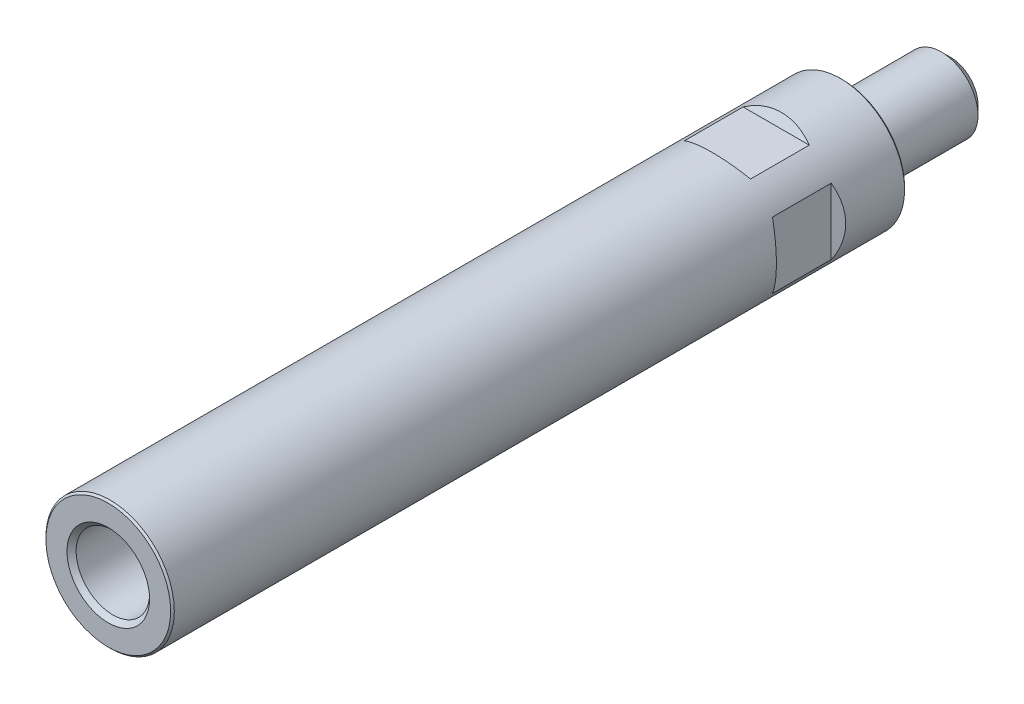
ISO-10303-21;
HEADER;
FILE_DESCRIPTION(('STEP AP214'),'2;1');
FILE_NAME('part.step','',(''),(''),'','','');
FILE_SCHEMA(('AUTOMOTIVE_DESIGN { 1 0 10303 214 1 1 1 1 }'));
ENDSEC;
DATA;
#1=APPLICATION_CONTEXT('core data for automotive mechanical design processes');
#2=APPLICATION_PROTOCOL_DEFINITION('international standard','automotive_design',2000,#1);
#3=PRODUCT_CONTEXT('',#1,'mechanical');
#4=PRODUCT('Part','Part','',(#3));
#5=PRODUCT_RELATED_PRODUCT_CATEGORY('part','',(#4));
#6=PRODUCT_DEFINITION_FORMATION('','',#4);
#7=PRODUCT_DEFINITION_CONTEXT('part definition',#1,'design');
#8=PRODUCT_DEFINITION('design','',#6,#7);
#9=PRODUCT_DEFINITION_SHAPE('','',#8);
#10=(LENGTH_UNIT() NAMED_UNIT(*) SI_UNIT(.MILLI.,.METRE.));
#11=(NAMED_UNIT(*) PLANE_ANGLE_UNIT() SI_UNIT($,.RADIAN.));
#12=(NAMED_UNIT(*) SI_UNIT($,.STERADIAN.) SOLID_ANGLE_UNIT());
#13=UNCERTAINTY_MEASURE_WITH_UNIT(LENGTH_MEASURE(1.E-05),#10,'distance_accuracy_value','');
#14=(GEOMETRIC_REPRESENTATION_CONTEXT(3) GLOBAL_UNCERTAINTY_ASSIGNED_CONTEXT((#13)) GLOBAL_UNIT_ASSIGNED_CONTEXT((#10,
#11,#12)) REPRESENTATION_CONTEXT('',''));
#15=CARTESIAN_POINT('',(0.,0.,0.));
#16=DIRECTION('',(0.,0.,1.));
#17=DIRECTION('',(1.,0.,0.));
#18=AXIS2_PLACEMENT_3D('',#15,#16,#17);
#19=CARTESIAN_POINT('',(0.,0.,-9.5));
#20=DIRECTION('',(0.,0.,1.));
#21=DIRECTION('',(1.,0.,0.));
#22=AXIS2_PLACEMENT_3D('',#19,#20,#21);
#23=CYLINDRICAL_SURFACE('',#22,10.);
#24=CARTESIAN_POINT('',(0.,0.,-27.));
#25=DIRECTION('',(0.,0.,1.));
#26=DIRECTION('',(1.,0.,0.));
#27=AXIS2_PLACEMENT_3D('',#24,#25,#26);
#28=CIRCLE('',#27,10.);
#29=CARTESIAN_POINT('',(10.,0.,-27.));
#30=VERTEX_POINT('',#29);
#31=EDGE_CURVE('E249',#30,#30,#28,.T.);
#32=ORIENTED_EDGE('',*,*,#31,.T.);
#33=EDGE_LOOP('',(#32));
#34=FACE_BOUND('',#33,.T.);
#35=CARTESIAN_POINT('',(0.,0.,1.25));
#36=DIRECTION('',(0.,0.,-1.));
#37=DIRECTION('',(-1.,0.,0.));
#38=AXIS2_PLACEMENT_3D('',#35,#36,#37);
#39=CIRCLE('',#38,10.);
#40=CARTESIAN_POINT('',(-10.,0.,1.25));
#41=VERTEX_POINT('',#40);
#42=EDGE_CURVE('E26',#41,#41,#39,.T.);
#43=ORIENTED_EDGE('',*,*,#42,.T.);
#44=EDGE_LOOP('',(#43));
#45=FACE_BOUND('',#44,.T.);
#46=ADVANCED_FACE('F15',(#34,#45),#23,.T.);
#47=CARTESIAN_POINT('',(0.,0.,-27.));
#48=DIRECTION('',(0.,0.,1.));
#49=DIRECTION('',(1.,0.,0.));
#50=AXIS2_PLACEMENT_3D('',#47,#48,#49);
#51=CONICAL_SURFACE('',#50,10.,0.785398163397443);
#52=CARTESIAN_POINT('',(0.,0.,-29.5));
#53=DIRECTION('',(0.,0.,1.));
#54=DIRECTION('',(1.,0.,0.));
#55=AXIS2_PLACEMENT_3D('',#52,#53,#54);
#56=CIRCLE('',#55,7.5);
#57=CARTESIAN_POINT('',(7.5,0.,-29.5));
#58=VERTEX_POINT('',#57);
#59=EDGE_CURVE('E19',#58,#58,#56,.T.);
#60=ORIENTED_EDGE('',*,*,#59,.T.);
#61=EDGE_LOOP('',(#60));
#62=FACE_BOUND('',#61,.T.);
#63=ORIENTED_EDGE('',*,*,#31,.F.);
#64=EDGE_LOOP('',(#63));
#65=FACE_BOUND('',#64,.T.);
#66=ADVANCED_FACE('F302',(#62,#65),#51,.T.);
#67=CARTESIAN_POINT('',(0.,0.,-29.5));
#68=DIRECTION('',(0.,0.,1.));
#69=DIRECTION('',(1.,0.,0.));
#70=AXIS2_PLACEMENT_3D('',#67,#68,#69);
#71=PLANE('',#70);
#72=ORIENTED_EDGE('',*,*,#59,.F.);
#73=EDGE_LOOP('',(#72));
#74=FACE_BOUND('',#73,.T.);
#75=ADVANCED_FACE('F17',(#74),#71,.F.);
#76=CARTESIAN_POINT('',(0.,0.,0.));
#77=DIRECTION('',(0.,0.,-1.));
#78=DIRECTION('',(-1.,0.,0.));
#79=AXIS2_PLACEMENT_3D('',#76,#77,#78);
#80=CONICAL_SURFACE('',#79,11.25,0.785398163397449);
#81=CARTESIAN_POINT('',(0.,0.,0.));
#82=DIRECTION('',(0.,0.,-1.));
#83=DIRECTION('',(-1.,0.,0.));
#84=AXIS2_PLACEMENT_3D('',#81,#82,#83);
#85=CIRCLE('',#84,11.25);
#86=CARTESIAN_POINT('',(-11.25,0.,0.));
#87=VERTEX_POINT('',#86);
#88=EDGE_CURVE('E202',#87,#87,#85,.T.);
#89=ORIENTED_EDGE('',*,*,#88,.T.);
#90=EDGE_LOOP('',(#89));
#91=FACE_BOUND('',#90,.T.);
#92=ORIENTED_EDGE('',*,*,#42,.F.);
#93=EDGE_LOOP('',(#92));
#94=FACE_BOUND('',#93,.T.);
#95=ADVANCED_FACE('F301',(#91,#94),#80,.F.);
#96=CARTESIAN_POINT('',(0.,0.,0.));
#97=DIRECTION('',(0.,0.,1.));
#98=DIRECTION('',(1.,0.,0.));
#99=AXIS2_PLACEMENT_3D('',#96,#97,#98);
#100=PLANE('',#99);
#101=CARTESIAN_POINT('',(0.,0.,0.));
#102=DIRECTION('',(0.,0.,1.));
#103=DIRECTION('',(1.,0.,0.));
#104=AXIS2_PLACEMENT_3D('',#101,#102,#103);
#105=CIRCLE('',#104,17.);
#106=CARTESIAN_POINT('',(17.,0.,0.));
#107=VERTEX_POINT('',#106);
#108=EDGE_CURVE('E193',#107,#107,#105,.F.);
#109=ORIENTED_EDGE('',*,*,#108,.T.);
#110=EDGE_LOOP('',(#109));
#111=FACE_BOUND('',#110,.T.);
#112=ORIENTED_EDGE('',*,*,#88,.F.);
#113=EDGE_LOOP('',(#112));
#114=FACE_BOUND('',#113,.T.);
#115=ADVANCED_FACE('F308',(#111,#114),#100,.F.);
#116=CARTESIAN_POINT('',(0.,0.,0.499999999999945));
#117=DIRECTION('',(0.,0.,1.));
#118=DIRECTION('',(1.,0.,0.));
#119=AXIS2_PLACEMENT_3D('',#116,#117,#118);
#120=CONICAL_SURFACE('',#119,17.5,0.785398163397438);
#121=ORIENTED_EDGE('',*,*,#108,.F.);
#122=EDGE_LOOP('',(#121));
#123=FACE_BOUND('',#122,.T.);
#124=CARTESIAN_POINT('',(0.,0.,0.499999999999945));
#125=DIRECTION('',(0.,0.,1.));
#126=DIRECTION('',(1.,0.,0.));
#127=AXIS2_PLACEMENT_3D('',#124,#125,#126);
#128=CIRCLE('',#127,17.5);
#129=CARTESIAN_POINT('',(17.5,0.,0.499999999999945));
#130=VERTEX_POINT('',#129);
#131=EDGE_CURVE('E190',#130,#130,#128,.T.);
#132=ORIENTED_EDGE('',*,*,#131,.F.);
#133=EDGE_LOOP('',(#132));
#134=FACE_BOUND('',#133,.T.);
#135=ADVANCED_FACE('F357',(#123,#134),#120,.T.);
#136=CARTESIAN_POINT('',(0.,0.,200.));
#137=DIRECTION('',(0.,0.,-1.));
#138=DIRECTION('',(-1.,0.,0.));
#139=AXIS2_PLACEMENT_3D('',#136,#137,#138);
#140=CYLINDRICAL_SURFACE('',#139,17.5);
#141=ORIENTED_EDGE('',*,*,#131,.T.);
#142=EDGE_LOOP('',(#141));
#143=FACE_BOUND('',#142,.T.);
#144=CARTESIAN_POINT('',(0.,0.,199.5));
#145=DIRECTION('',(0.,0.,1.));
#146=DIRECTION('',(1.,0.,0.));
#147=AXIS2_PLACEMENT_3D('',#144,#145,#146);
#148=CIRCLE('',#147,17.5);
#149=CARTESIAN_POINT('',(17.5,0.,199.5));
#150=VERTEX_POINT('',#149);
#151=EDGE_CURVE('E187',#150,#150,#148,.F.);
#152=ORIENTED_EDGE('',*,*,#151,.T.);
#153=EDGE_LOOP('',(#152));
#154=FACE_BOUND('',#153,.T.);
#155=CARTESIAN_POINT('',(0.,0.,26.6602540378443));
#156=DIRECTION('',(0.5,0.,-0.86602540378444));
#157=DIRECTION('',(-0.86602540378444,0.,-0.5));
#158=AXIS2_PLACEMENT_3D('',#155,#156,#157);
#159=ELLIPSE('',#158,20.2072594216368,17.5);
#160=CARTESIAN_POINT('',(-15.,-9.01387818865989,18.));
#161=VERTEX_POINT('',#160);
#162=CARTESIAN_POINT('',(-15.,9.01387818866,18.));
#163=VERTEX_POINT('',#162);
#164=EDGE_CURVE('E176',#161,#163,#159,.T.);
#165=ORIENTED_EDGE('',*,*,#164,.T.);
#166=DIRECTION('',(0.,0.,-1.));
#167=VECTOR('',#166,1.);
#168=CARTESIAN_POINT('',(-15.,9.01387818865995,200.));
#169=LINE('',#168,#167);
#170=CARTESIAN_POINT('',(-15.,9.01387818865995,34.));
#171=VERTEX_POINT('',#170);
#172=EDGE_CURVE('E184',#163,#171,#169,.F.);
#173=ORIENTED_EDGE('',*,*,#172,.T.);
#174=CARTESIAN_POINT('',(0.,0.,25.3397459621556));
#175=DIRECTION('',(0.5,0.,0.86602540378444));
#176=DIRECTION('',(0.86602540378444,0.,-0.5));
#177=AXIS2_PLACEMENT_3D('',#174,#175,#176);
#178=ELLIPSE('',#177,20.2072594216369,17.5);
#179=CARTESIAN_POINT('',(-15.,-9.01387818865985,34.));
#180=VERTEX_POINT('',#179);
#181=EDGE_CURVE('E181',#171,#180,#178,.T.);
#182=ORIENTED_EDGE('',*,*,#181,.T.);
#183=DIRECTION('',(0.,0.,-1.));
#184=VECTOR('',#183,1.);
#185=CARTESIAN_POINT('',(-15.,-9.01387818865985,200.));
#186=LINE('',#185,#184);
#187=EDGE_CURVE('E178',#180,#161,#186,.T.);
#188=ORIENTED_EDGE('',*,*,#187,.T.);
#189=EDGE_LOOP('',(#165,#173,#182,#188));
#190=FACE_BOUND('',#189,.T.);
#191=CARTESIAN_POINT('',(0.,0.,26.6602540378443));
#192=DIRECTION('',(-0.5,0.,-0.86602540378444));
#193=DIRECTION('',(0.86602540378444,0.,-0.5));
#194=AXIS2_PLACEMENT_3D('',#191,#192,#193);
#195=ELLIPSE('',#194,20.2072594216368,17.5);
#196=CARTESIAN_POINT('',(15.,9.01387818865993,18.));
#197=VERTEX_POINT('',#196);
#198=CARTESIAN_POINT('',(15.,-9.01387818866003,18.));
#199=VERTEX_POINT('',#198);
#200=EDGE_CURVE('E174',#197,#199,#195,.T.);
#201=ORIENTED_EDGE('',*,*,#200,.T.);
#202=DIRECTION('',(0.,0.,-1.));
#203=VECTOR('',#202,1.);
#204=CARTESIAN_POINT('',(15.,-9.01387818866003,200.));
#205=LINE('',#204,#203);
#206=CARTESIAN_POINT('',(15.,-9.01387818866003,34.));
#207=VERTEX_POINT('',#206);
#208=EDGE_CURVE('E168',#199,#207,#205,.F.);
#209=ORIENTED_EDGE('',*,*,#208,.T.);
#210=CARTESIAN_POINT('',(0.,0.,25.3397459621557));
#211=DIRECTION('',(-0.5,0.,0.86602540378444));
#212=DIRECTION('',(-0.86602540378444,0.,-0.5));
#213=AXIS2_PLACEMENT_3D('',#210,#211,#212);
#214=ELLIPSE('',#213,20.2072594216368,17.5);
#215=CARTESIAN_POINT('',(15.,9.01387818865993,34.));
#216=VERTEX_POINT('',#215);
#217=EDGE_CURVE('E165',#207,#216,#214,.T.);
#218=ORIENTED_EDGE('',*,*,#217,.T.);
#219=DIRECTION('',(0.,0.,-1.));
#220=VECTOR('',#219,1.);
#221=CARTESIAN_POINT('',(15.,9.01387818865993,200.));
#222=LINE('',#221,#220);
#223=EDGE_CURVE('E171',#216,#197,#222,.T.);
#224=ORIENTED_EDGE('',*,*,#223,.T.);
#225=EDGE_LOOP('',(#201,#209,#218,#224));
#226=FACE_BOUND('',#225,.T.);
#227=CARTESIAN_POINT('',(0.,0.,26.6602540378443));
#228=DIRECTION('',(0.,0.5,-0.86602540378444));
#229=DIRECTION('',(0.,-0.86602540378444,-0.5));
#230=AXIS2_PLACEMENT_3D('',#227,#228,#229);
#231=ELLIPSE('',#230,20.2072594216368,17.5);
#232=CARTESIAN_POINT('',(9.01387818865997,-15.,18.));
#233=VERTEX_POINT('',#232);
#234=CARTESIAN_POINT('',(-9.01387818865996,-15.,18.));
#235=VERTEX_POINT('',#234);
#236=EDGE_CURVE('E136',#233,#235,#231,.T.);
#237=ORIENTED_EDGE('',*,*,#236,.T.);
#238=DIRECTION('',(0.,0.,-1.));
#239=VECTOR('',#238,1.);
#240=CARTESIAN_POINT('',(-9.0138781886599,-15.,200.));
#241=LINE('',#240,#239);
#242=CARTESIAN_POINT('',(-9.0138781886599,-15.,34.));
#243=VERTEX_POINT('',#242);
#244=EDGE_CURVE('E162',#235,#243,#241,.F.);
#245=ORIENTED_EDGE('',*,*,#244,.T.);
#246=CARTESIAN_POINT('',(0.,0.,25.3397459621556));
#247=DIRECTION('',(0.,0.5,0.86602540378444));
#248=DIRECTION('',(0.,0.86602540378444,-0.5));
#249=AXIS2_PLACEMENT_3D('',#246,#247,#248);
#250=ELLIPSE('',#249,20.2072594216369,17.5);
#251=CARTESIAN_POINT('',(9.0138781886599,-15.,34.));
#252=VERTEX_POINT('',#251);
#253=EDGE_CURVE('E159',#243,#252,#250,.T.);
#254=ORIENTED_EDGE('',*,*,#253,.T.);
#255=DIRECTION('',(0.,0.,-1.));
#256=VECTOR('',#255,1.);
#257=CARTESIAN_POINT('',(9.0138781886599,-15.,200.));
#258=LINE('',#257,#256);
#259=EDGE_CURVE('E156',#252,#233,#258,.T.);
#260=ORIENTED_EDGE('',*,*,#259,.T.);
#261=EDGE_LOOP('',(#237,#245,#254,#260));
#262=FACE_BOUND('',#261,.T.);
#263=CARTESIAN_POINT('',(0.,0.,26.6602540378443));
#264=DIRECTION('',(0.,-0.5,-0.86602540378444));
#265=DIRECTION('',(0.,0.86602540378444,-0.5));
#266=AXIS2_PLACEMENT_3D('',#263,#264,#265);
#267=ELLIPSE('',#266,20.2072594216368,17.5);
#268=CARTESIAN_POINT('',(-9.01387818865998,15.,18.));
#269=VERTEX_POINT('',#268);
#270=CARTESIAN_POINT('',(9.01387818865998,15.,18.));
#271=VERTEX_POINT('',#270);
#272=EDGE_CURVE('E126',#269,#271,#267,.T.);
#273=ORIENTED_EDGE('',*,*,#272,.T.);
#274=DIRECTION('',(0.,0.,-1.));
#275=VECTOR('',#274,1.);
#276=CARTESIAN_POINT('',(9.01387818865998,15.,200.));
#277=LINE('',#276,#275);
#278=CARTESIAN_POINT('',(9.01387818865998,15.,34.));
#279=VERTEX_POINT('',#278);
#280=EDGE_CURVE('E130',#271,#279,#277,.F.);
#281=ORIENTED_EDGE('',*,*,#280,.T.);
#282=CARTESIAN_POINT('',(0.,0.,25.3397459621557));
#283=DIRECTION('',(0.,-0.5,0.86602540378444));
#284=DIRECTION('',(0.,-0.86602540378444,-0.5));
#285=AXIS2_PLACEMENT_3D('',#282,#283,#284);
#286=ELLIPSE('',#285,20.2072594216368,17.5);
#287=CARTESIAN_POINT('',(-9.01387818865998,15.,34.));
#288=VERTEX_POINT('',#287);
#289=EDGE_CURVE('E143',#279,#288,#286,.T.);
#290=ORIENTED_EDGE('',*,*,#289,.T.);
#291=DIRECTION('',(0.,0.,-1.));
#292=VECTOR('',#291,1.);
#293=CARTESIAN_POINT('',(-9.01387818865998,15.,200.));
#294=LINE('',#293,#292);
#295=EDGE_CURVE('E132',#288,#269,#294,.T.);
#296=ORIENTED_EDGE('',*,*,#295,.T.);
#297=EDGE_LOOP('',(#273,#281,#290,#296));
#298=FACE_BOUND('',#297,.T.);
#299=ADVANCED_FACE('F128',(#143,#154,#190,#226,#262,#298),#140,.T.);
#300=CARTESIAN_POINT('',(0.,0.,200.));
#301=DIRECTION('',(0.,0.,-1.));
#302=DIRECTION('',(-1.,0.,0.));
#303=AXIS2_PLACEMENT_3D('',#300,#301,#302);
#304=CONICAL_SURFACE('',#303,17.,0.785398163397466);
#305=ORIENTED_EDGE('',*,*,#151,.F.);
#306=EDGE_LOOP('',(#305));
#307=FACE_BOUND('',#306,.T.);
#308=CARTESIAN_POINT('',(0.,0.,200.));
#309=DIRECTION('',(0.,0.,1.));
#310=DIRECTION('',(1.,0.,0.));
#311=AXIS2_PLACEMENT_3D('',#308,#309,#310);
#312=CIRCLE('',#311,17.);
#313=CARTESIAN_POINT('',(17.,0.,200.));
#314=VERTEX_POINT('',#313);
#315=EDGE_CURVE('E196',#314,#314,#312,.T.);
#316=ORIENTED_EDGE('',*,*,#315,.F.);
#317=EDGE_LOOP('',(#316));
#318=FACE_BOUND('',#317,.T.);
#319=ADVANCED_FACE('F352',(#307,#318),#304,.T.);
#320=CARTESIAN_POINT('',(-15.,10.,18.));
#321=DIRECTION('',(0.5,0.,-0.86602540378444));
#322=DIRECTION('',(-0.86602540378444,0.,-0.5));
#323=AXIS2_PLACEMENT_3D('',#320,#321,#322);
#324=PLANE('',#323);
#325=ORIENTED_EDGE('',*,*,#164,.F.);
#326=DIRECTION('',(0.,-1.,0.));
#327=VECTOR('',#326,1.);
#328=CARTESIAN_POINT('',(-15.,10.,18.));
#329=LINE('',#328,#327);
#330=EDGE_CURVE('E269',#163,#161,#329,.T.);
#331=ORIENTED_EDGE('',*,*,#330,.F.);
#332=EDGE_LOOP('',(#325,#331));
#333=FACE_BOUND('',#332,.T.);
#334=ADVANCED_FACE('F355',(#333),#324,.F.);
#335=CARTESIAN_POINT('',(-15.,10.,34.));
#336=DIRECTION('',(1.,0.,0.));
#337=DIRECTION('',(0.,1.,0.));
#338=AXIS2_PLACEMENT_3D('',#335,#336,#337);
#339=PLANE('',#338);
#340=DIRECTION('',(0.,-1.,0.));
#341=VECTOR('',#340,1.);
#342=CARTESIAN_POINT('',(-15.,10.,34.));
#343=LINE('',#342,#341);
#344=EDGE_CURVE('E270',#171,#180,#343,.T.);
#345=ORIENTED_EDGE('',*,*,#344,.F.);
#346=ORIENTED_EDGE('',*,*,#172,.F.);
#347=ORIENTED_EDGE('',*,*,#330,.T.);
#348=ORIENTED_EDGE('',*,*,#187,.F.);
#349=EDGE_LOOP('',(#345,#346,#347,#348));
#350=FACE_BOUND('',#349,.T.);
#351=ADVANCED_FACE('F551',(#350),#339,.F.);
#352=CARTESIAN_POINT('',(-17.5,10.,35.443375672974));
#353=DIRECTION('',(0.5,0.,0.86602540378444));
#354=DIRECTION('',(0.86602540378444,0.,-0.5));
#355=AXIS2_PLACEMENT_3D('',#352,#353,#354);
#356=PLANE('',#355);
#357=ORIENTED_EDGE('',*,*,#344,.T.);
#358=ORIENTED_EDGE('',*,*,#181,.F.);
#359=EDGE_LOOP('',(#357,#358));
#360=FACE_BOUND('',#359,.T.);
#361=ADVANCED_FACE('F542',(#360),#356,.F.);
#362=CARTESIAN_POINT('',(15.,10.,18.));
#363=DIRECTION('',(-0.5,0.,-0.86602540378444));
#364=DIRECTION('',(-0.86602540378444,0.,0.5));
#365=AXIS2_PLACEMENT_3D('',#362,#363,#364);
#366=PLANE('',#365);
#367=ORIENTED_EDGE('',*,*,#200,.F.);
#368=DIRECTION('',(0.,-1.,0.));
#369=VECTOR('',#368,1.);
#370=CARTESIAN_POINT('',(15.,10.,18.));
#371=LINE('',#370,#369);
#372=EDGE_CURVE('E275',#197,#199,#371,.T.);
#373=ORIENTED_EDGE('',*,*,#372,.T.);
#374=EDGE_LOOP('',(#367,#373));
#375=FACE_BOUND('',#374,.T.);
#376=ADVANCED_FACE('F533',(#375),#366,.F.);
#377=CARTESIAN_POINT('',(15.,10.,34.));
#378=DIRECTION('',(-1.,0.,0.));
#379=DIRECTION('',(0.,-1.,0.));
#380=AXIS2_PLACEMENT_3D('',#377,#378,#379);
#381=PLANE('',#380);
#382=DIRECTION('',(0.,-1.,0.));
#383=VECTOR('',#382,1.);
#384=CARTESIAN_POINT('',(15.,10.,34.));
#385=LINE('',#384,#383);
#386=EDGE_CURVE('E34',#216,#207,#385,.T.);
#387=ORIENTED_EDGE('',*,*,#386,.T.);
#388=ORIENTED_EDGE('',*,*,#208,.F.);
#389=ORIENTED_EDGE('',*,*,#372,.F.);
#390=ORIENTED_EDGE('',*,*,#223,.F.);
#391=EDGE_LOOP('',(#387,#388,#389,#390));
#392=FACE_BOUND('',#391,.T.);
#393=ADVANCED_FACE('F525',(#392),#381,.F.);
#394=CARTESIAN_POINT('',(17.5,10.,35.443375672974));
#395=DIRECTION('',(-0.5,0.,0.86602540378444));
#396=DIRECTION('',(0.86602540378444,0.,0.5));
#397=AXIS2_PLACEMENT_3D('',#394,#395,#396);
#398=PLANE('',#397);
#399=ORIENTED_EDGE('',*,*,#386,.F.);
#400=ORIENTED_EDGE('',*,*,#217,.F.);
#401=EDGE_LOOP('',(#399,#400));
#402=FACE_BOUND('',#401,.T.);
#403=ADVANCED_FACE('F517',(#402),#398,.F.);
#404=CARTESIAN_POINT('',(-10.,-15.,18.));
#405=DIRECTION('',(0.,0.5,-0.86602540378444));
#406=DIRECTION('',(0.,0.86602540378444,0.5));
#407=AXIS2_PLACEMENT_3D('',#404,#405,#406);
#408=PLANE('',#407);
#409=ORIENTED_EDGE('',*,*,#236,.F.);
#410=DIRECTION('',(1.,0.,0.));
#411=VECTOR('',#410,1.);
#412=CARTESIAN_POINT('',(-10.,-15.,18.));
#413=LINE('',#412,#411);
#414=EDGE_CURVE('E151',#235,#233,#413,.T.);
#415=ORIENTED_EDGE('',*,*,#414,.F.);
#416=EDGE_LOOP('',(#409,#415));
#417=FACE_BOUND('',#416,.T.);
#418=ADVANCED_FACE('F297',(#417),#408,.F.);
#419=CARTESIAN_POINT('',(-10.,-15.,34.));
#420=DIRECTION('',(0.,1.,0.));
#421=DIRECTION('',(0.,0.,1.));
#422=AXIS2_PLACEMENT_3D('',#419,#420,#421);
#423=PLANE('',#422);
#424=DIRECTION('',(1.,0.,0.));
#425=VECTOR('',#424,1.);
#426=CARTESIAN_POINT('',(-10.,-15.,34.));
#427=LINE('',#426,#425);
#428=EDGE_CURVE('E148',#243,#252,#427,.T.);
#429=ORIENTED_EDGE('',*,*,#428,.F.);
#430=ORIENTED_EDGE('',*,*,#244,.F.);
#431=ORIENTED_EDGE('',*,*,#414,.T.);
#432=ORIENTED_EDGE('',*,*,#259,.F.);
#433=EDGE_LOOP('',(#429,#430,#431,#432));
#434=FACE_BOUND('',#433,.T.);
#435=ADVANCED_FACE('F285',(#434),#423,.F.);
#436=CARTESIAN_POINT('',(-10.,-17.5,35.443375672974));
#437=DIRECTION('',(0.,0.5,0.86602540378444));
#438=DIRECTION('',(0.,-0.86602540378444,0.5));
#439=AXIS2_PLACEMENT_3D('',#436,#437,#438);
#440=PLANE('',#439);
#441=ORIENTED_EDGE('',*,*,#428,.T.);
#442=ORIENTED_EDGE('',*,*,#253,.F.);
#443=EDGE_LOOP('',(#441,#442));
#444=FACE_BOUND('',#443,.T.);
#445=ADVANCED_FACE('F288',(#444),#440,.F.);
#446=CARTESIAN_POINT('',(-10.,15.,18.));
#447=DIRECTION('',(0.,-0.5,-0.86602540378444));
#448=DIRECTION('',(0.,0.86602540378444,-0.5));
#449=AXIS2_PLACEMENT_3D('',#446,#447,#448);
#450=PLANE('',#449);
#451=ORIENTED_EDGE('',*,*,#272,.F.);
#452=DIRECTION('',(1.,0.,0.));
#453=VECTOR('',#452,1.);
#454=CARTESIAN_POINT('',(-10.,15.,18.));
#455=LINE('',#454,#453);
#456=EDGE_CURVE('E141',#269,#271,#455,.T.);
#457=ORIENTED_EDGE('',*,*,#456,.T.);
#458=EDGE_LOOP('',(#451,#457));
#459=FACE_BOUND('',#458,.T.);
#460=ADVANCED_FACE('F145',(#459),#450,.F.);
#461=CARTESIAN_POINT('',(-10.,15.,34.));
#462=DIRECTION('',(0.,-1.,0.));
#463=DIRECTION('',(0.,0.,-1.));
#464=AXIS2_PLACEMENT_3D('',#461,#462,#463);
#465=PLANE('',#464);
#466=DIRECTION('',(1.,0.,0.));
#467=VECTOR('',#466,1.);
#468=CARTESIAN_POINT('',(-10.,15.,34.));
#469=LINE('',#468,#467);
#470=EDGE_CURVE('E142',#288,#279,#469,.T.);
#471=ORIENTED_EDGE('',*,*,#470,.T.);
#472=ORIENTED_EDGE('',*,*,#280,.F.);
#473=ORIENTED_EDGE('',*,*,#456,.F.);
#474=ORIENTED_EDGE('',*,*,#295,.F.);
#475=EDGE_LOOP('',(#471,#472,#473,#474));
#476=FACE_BOUND('',#475,.T.);
#477=ADVANCED_FACE('F140',(#476),#465,.F.);
#478=CARTESIAN_POINT('',(-10.,17.5,35.443375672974));
#479=DIRECTION('',(0.,-0.5,0.86602540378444));
#480=DIRECTION('',(0.,-0.86602540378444,-0.5));
#481=AXIS2_PLACEMENT_3D('',#478,#479,#480);
#482=PLANE('',#481);
#483=ORIENTED_EDGE('',*,*,#470,.F.);
#484=ORIENTED_EDGE('',*,*,#289,.F.);
#485=EDGE_LOOP('',(#483,#484));
#486=FACE_BOUND('',#485,.T.);
#487=ADVANCED_FACE('F371',(#486),#482,.F.);
#488=CARTESIAN_POINT('',(0.,0.,200.));
#489=DIRECTION('',(0.,0.,1.));
#490=DIRECTION('',(1.,0.,0.));
#491=AXIS2_PLACEMENT_3D('',#488,#489,#490);
#492=PLANE('',#491);
#493=ORIENTED_EDGE('',*,*,#315,.T.);
#494=EDGE_LOOP('',(#493));
#495=FACE_BOUND('',#494,.T.);
#496=CARTESIAN_POINT('',(0.,0.,200.));
#497=DIRECTION('',(0.,0.,1.));
#498=DIRECTION('',(1.,0.,0.));
#499=AXIS2_PLACEMENT_3D('',#496,#497,#498);
#500=CIRCLE('',#499,11.25);
#501=CARTESIAN_POINT('',(11.25,0.,200.));
#502=VERTEX_POINT('',#501);
#503=EDGE_CURVE('E266',#502,#502,#500,.T.);
#504=ORIENTED_EDGE('',*,*,#503,.F.);
#505=EDGE_LOOP('',(#504));
#506=FACE_BOUND('',#505,.T.);
#507=ADVANCED_FACE('F367',(#495,#506),#492,.T.);
#508=CARTESIAN_POINT('',(0.,0.,200.));
#509=DIRECTION('',(0.,0.,1.));
#510=DIRECTION('',(1.,0.,0.));
#511=AXIS2_PLACEMENT_3D('',#508,#509,#510);
#512=CONICAL_SURFACE('',#511,11.25,0.785398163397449);
#513=CARTESIAN_POINT('',(0.,0.,198.75));
#514=DIRECTION('',(0.,0.,1.));
#515=DIRECTION('',(1.,0.,0.));
#516=AXIS2_PLACEMENT_3D('',#513,#514,#515);
#517=CIRCLE('',#516,10.);
#518=CARTESIAN_POINT('',(10.,0.,198.75));
#519=VERTEX_POINT('',#518);
#520=EDGE_CURVE('E199',#519,#519,#517,.F.);
#521=ORIENTED_EDGE('',*,*,#520,.T.);
#522=EDGE_LOOP('',(#521));
#523=FACE_BOUND('',#522,.T.);
#524=ORIENTED_EDGE('',*,*,#503,.T.);
#525=EDGE_LOOP('',(#524));
#526=FACE_BOUND('',#525,.T.);
#527=ADVANCED_FACE('F370',(#523,#526),#512,.F.);
#528=CARTESIAN_POINT('',(0.,0.,150.));
#529=DIRECTION('',(0.,0.,1.));
#530=DIRECTION('',(1.,0.,0.));
#531=AXIS2_PLACEMENT_3D('',#528,#529,#530);
#532=CYLINDRICAL_SURFACE('',#531,10.);
#533=CARTESIAN_POINT('',(0.,0.,150.));
#534=DIRECTION('',(0.,0.,1.));
#535=DIRECTION('',(1.,0.,0.));
#536=AXIS2_PLACEMENT_3D('',#533,#534,#535);
#537=CIRCLE('',#536,10.);
#538=CARTESIAN_POINT('',(10.,0.,150.));
#539=VERTEX_POINT('',#538);
#540=EDGE_CURVE('E203',#539,#539,#537,.T.);
#541=ORIENTED_EDGE('',*,*,#540,.F.);
#542=EDGE_LOOP('',(#541));
#543=FACE_BOUND('',#542,.T.);
#544=ORIENTED_EDGE('',*,*,#520,.F.);
#545=EDGE_LOOP('',(#544));
#546=FACE_BOUND('',#545,.T.);
#547=ADVANCED_FACE('F400',(#543,#546),#532,.F.);
#548=CARTESIAN_POINT('',(0.,0.,150.));
#549=DIRECTION('',(0.,0.,1.));
#550=DIRECTION('',(1.,0.,0.));
#551=AXIS2_PLACEMENT_3D('',#548,#549,#550);
#552=PLANE('',#551);
#553=ORIENTED_EDGE('',*,*,#540,.T.);
#554=EDGE_LOOP('',(#553));
#555=FACE_BOUND('',#554,.T.);
#556=ADVANCED_FACE('F315',(#555),#552,.T.);
#557=CLOSED_SHELL('',(#46,#66,#75,#95,#115,#135,#299,#319,#334,#351,#361,#376,#393,#403,#418,
#435,#445,#460,#477,#487,#507,#527,#547,#556));
#558=CARTESIAN_POINT('',(0.,0.,0.));
#559=DIRECTION('',(0.,0.,-1.));
#560=DIRECTION('',(-1.,0.,0.));
#561=AXIS2_PLACEMENT_3D('',#558,#559,#560);
#562=CYLINDRICAL_SURFACE('',#561,8.75);
#563=CARTESIAN_POINT('',(0.,0.,35.));
#564=DIRECTION('',(0.,0.,-1.));
#565=DIRECTION('',(-1.,0.,0.));
#566=AXIS2_PLACEMENT_3D('',#563,#564,#565);
#567=CIRCLE('',#566,8.75);
#568=CARTESIAN_POINT('',(-8.75,0.,35.));
#569=VERTEX_POINT('',#568);
#570=EDGE_CURVE('E263',#569,#569,#567,.T.);
#571=ORIENTED_EDGE('',*,*,#570,.F.);
#572=EDGE_LOOP('',(#571));
#573=FACE_BOUND('',#572,.T.);
#574=CARTESIAN_POINT('',(0.,0.,20.5));
#575=DIRECTION('',(0.,0.,-1.));
#576=DIRECTION('',(-1.,0.,0.));
#577=AXIS2_PLACEMENT_3D('',#574,#575,#576);
#578=CIRCLE('',#577,8.75);
#579=CARTESIAN_POINT('',(-8.75,0.,20.5));
#580=VERTEX_POINT('',#579);
#581=EDGE_CURVE('E9',#580,#580,#578,.F.);
#582=ORIENTED_EDGE('',*,*,#581,.F.);
#583=EDGE_LOOP('',(#582));
#584=FACE_BOUND('',#583,.T.);
#585=ADVANCED_FACE('F346',(#573,#584),#562,.F.);
#586=CARTESIAN_POINT('',(0.,0.,35.));
#587=DIRECTION('',(0.,0.,-1.));
#588=DIRECTION('',(-1.,0.,0.));
#589=AXIS2_PLACEMENT_3D('',#586,#587,#588);
#590=CONICAL_SURFACE('',#589,8.75,1.02974425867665);
#591=CARTESIAN_POINT('',(0.,0.,40.2575304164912));
#592=VERTEX_POINT('',#591);
#593=VERTEX_LOOP('',#592);
#594=FACE_BOUND('',#593,.T.);
#595=ORIENTED_EDGE('',*,*,#570,.T.);
#596=EDGE_LOOP('',(#595));
#597=FACE_BOUND('',#596,.T.);
#598=ADVANCED_FACE('F322',(#594,#597),#590,.F.);
#599=CARTESIAN_POINT('',(10.,0.,20.5));
#600=DIRECTION('',(0.,0.,-1.));
#601=DIRECTION('',(-1.,0.,0.));
#602=AXIS2_PLACEMENT_3D('',#599,#600,#601);
#603=PLANE('',#602);
#604=DIRECTION('',(0.866025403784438,-0.5,0.));
#605=VECTOR('',#604,1.);
#606=CARTESIAN_POINT('',(0.,5.77350269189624,20.5));
#607=LINE('',#606,#605);
#608=CARTESIAN_POINT('',(0.,5.77350269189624,20.5));
#609=VERTEX_POINT('',#608);
#610=CARTESIAN_POINT('',(5.,2.88675134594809,20.5));
#611=VERTEX_POINT('',#610);
#612=EDGE_CURVE('E80',#609,#611,#607,.T.);
#613=ORIENTED_EDGE('',*,*,#612,.T.);
#614=DIRECTION('',(0.,-1.,0.));
#615=VECTOR('',#614,1.);
#616=CARTESIAN_POINT('',(5.,2.88675134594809,20.5));
#617=LINE('',#616,#615);
#618=CARTESIAN_POINT('',(5.,-2.88675134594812,20.5));
#619=VERTEX_POINT('',#618);
#620=EDGE_CURVE('E219',#611,#619,#617,.T.);
#621=ORIENTED_EDGE('',*,*,#620,.T.);
#622=DIRECTION('',(0.866025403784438,0.5,0.));
#623=VECTOR('',#622,1.);
#624=CARTESIAN_POINT('',(0.,-5.77350269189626,20.5));
#625=LINE('',#624,#623);
#626=CARTESIAN_POINT('',(0.,-5.77350269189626,20.5));
#627=VERTEX_POINT('',#626);
#628=EDGE_CURVE('E216',#627,#619,#625,.T.);
#629=ORIENTED_EDGE('',*,*,#628,.F.);
#630=DIRECTION('',(-0.866025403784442,0.5,0.));
#631=VECTOR('',#630,1.);
#632=CARTESIAN_POINT('',(0.,-5.77350269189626,20.5));
#633=LINE('',#632,#631);
#634=CARTESIAN_POINT('',(-5.,-2.88675134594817,20.5));
#635=VERTEX_POINT('',#634);
#636=EDGE_CURVE('E213',#627,#635,#633,.T.);
#637=ORIENTED_EDGE('',*,*,#636,.T.);
#638=DIRECTION('',(0.,-1.,0.));
#639=VECTOR('',#638,1.);
#640=CARTESIAN_POINT('',(-5.,2.88675134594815,20.5));
#641=LINE('',#640,#639);
#642=CARTESIAN_POINT('',(-5.,2.88675134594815,20.5));
#643=VERTEX_POINT('',#642);
#644=EDGE_CURVE('E210',#643,#635,#641,.T.);
#645=ORIENTED_EDGE('',*,*,#644,.F.);
#646=DIRECTION('',(-0.866025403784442,-0.499999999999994,0.));
#647=VECTOR('',#646,1.);
#648=CARTESIAN_POINT('',(0.,5.77350269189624,20.5));
#649=LINE('',#648,#647);
#650=EDGE_CURVE('E206',#609,#643,#649,.T.);
#651=ORIENTED_EDGE('',*,*,#650,.F.);
#652=EDGE_LOOP('',(#613,#621,#629,#637,#645,#651));
#653=FACE_BOUND('',#652,.T.);
#654=ORIENTED_EDGE('',*,*,#581,.T.);
#655=EDGE_LOOP('',(#654));
#656=FACE_BOUND('',#655,.T.);
#657=ADVANCED_FACE('F318',(#653,#656),#603,.F.);
#658=CARTESIAN_POINT('',(0.,5.77350269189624,12.5));
#659=DIRECTION('',(-0.5,-0.866025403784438,0.));
#660=DIRECTION('',(0.866025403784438,-0.5,0.));
#661=AXIS2_PLACEMENT_3D('',#658,#659,#660);
#662=PLANE('',#661);
#663=DIRECTION('',(0.,0.,1.));
#664=VECTOR('',#663,1.);
#665=CARTESIAN_POINT('',(5.,2.88675134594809,12.5));
#666=LINE('',#665,#664);
#667=CARTESIAN_POINT('',(5.,2.88675134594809,12.5));
#668=VERTEX_POINT('',#667);
#669=EDGE_CURVE('E248',#668,#611,#666,.T.);
#670=ORIENTED_EDGE('',*,*,#669,.T.);
#671=ORIENTED_EDGE('',*,*,#612,.F.);
#672=DIRECTION('',(0.,0.,1.));
#673=VECTOR('',#672,1.);
#674=CARTESIAN_POINT('',(0.,5.77350269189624,12.5));
#675=LINE('',#674,#673);
#676=CARTESIAN_POINT('',(0.,5.77350269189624,12.5));
#677=VERTEX_POINT('',#676);
#678=EDGE_CURVE('E76',#677,#609,#675,.T.);
#679=ORIENTED_EDGE('',*,*,#678,.F.);
#680=DIRECTION('',(0.866025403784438,-0.5,0.));
#681=VECTOR('',#680,1.);
#682=CARTESIAN_POINT('',(0.,5.77350269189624,12.5));
#683=LINE('',#682,#681);
#684=EDGE_CURVE('E209',#677,#668,#683,.T.);
#685=ORIENTED_EDGE('',*,*,#684,.T.);
#686=EDGE_LOOP('',(#670,#671,#679,#685));
#687=FACE_BOUND('',#686,.T.);
#688=ADVANCED_FACE('F321',(#687),#662,.T.);
#689=CARTESIAN_POINT('',(5.,2.88675134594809,12.5));
#690=DIRECTION('',(-1.,0.,0.));
#691=DIRECTION('',(0.,0.,1.));
#692=AXIS2_PLACEMENT_3D('',#689,#690,#691);
#693=PLANE('',#692);
#694=DIRECTION('',(0.,0.,1.));
#695=VECTOR('',#694,1.);
#696=CARTESIAN_POINT('',(5.,-2.88675134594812,12.5));
#697=LINE('',#696,#695);
#698=CARTESIAN_POINT('',(5.,-2.88675134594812,12.5));
#699=VERTEX_POINT('',#698);
#700=EDGE_CURVE('E246',#699,#619,#697,.T.);
#701=ORIENTED_EDGE('',*,*,#700,.T.);
#702=ORIENTED_EDGE('',*,*,#620,.F.);
#703=ORIENTED_EDGE('',*,*,#669,.F.);
#704=DIRECTION('',(0.,-1.,0.));
#705=VECTOR('',#704,1.);
#706=CARTESIAN_POINT('',(5.,2.88675134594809,12.5));
#707=LINE('',#706,#705);
#708=EDGE_CURVE('E235',#668,#699,#707,.T.);
#709=ORIENTED_EDGE('',*,*,#708,.T.);
#710=EDGE_LOOP('',(#701,#702,#703,#709));
#711=FACE_BOUND('',#710,.T.);
#712=ADVANCED_FACE('F325',(#711),#693,.T.);
#713=CARTESIAN_POINT('',(0.,-5.77350269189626,12.5));
#714=DIRECTION('',(0.5,-0.866025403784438,0.));
#715=DIRECTION('',(0.866025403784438,0.5,0.));
#716=AXIS2_PLACEMENT_3D('',#713,#714,#715);
#717=PLANE('',#716);
#718=DIRECTION('',(0.,0.,1.));
#719=VECTOR('',#718,1.);
#720=CARTESIAN_POINT('',(0.,-5.77350269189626,12.5));
#721=LINE('',#720,#719);
#722=CARTESIAN_POINT('',(0.,-5.77350269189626,12.5));
#723=VERTEX_POINT('',#722);
#724=EDGE_CURVE('E244',#723,#627,#721,.T.);
#725=ORIENTED_EDGE('',*,*,#724,.T.);
#726=ORIENTED_EDGE('',*,*,#628,.T.);
#727=ORIENTED_EDGE('',*,*,#700,.F.);
#728=DIRECTION('',(0.866025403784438,0.5,0.));
#729=VECTOR('',#728,1.);
#730=CARTESIAN_POINT('',(0.,-5.77350269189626,12.5));
#731=LINE('',#730,#729);
#732=EDGE_CURVE('E232',#723,#699,#731,.T.);
#733=ORIENTED_EDGE('',*,*,#732,.F.);
#734=EDGE_LOOP('',(#725,#726,#727,#733));
#735=FACE_BOUND('',#734,.T.);
#736=ADVANCED_FACE('F328',(#735),#717,.F.);
#737=CARTESIAN_POINT('',(0.,-5.77350269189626,12.5));
#738=DIRECTION('',(0.5,0.866025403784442,0.));
#739=DIRECTION('',(-0.866025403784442,0.5,0.));
#740=AXIS2_PLACEMENT_3D('',#737,#738,#739);
#741=PLANE('',#740);
#742=DIRECTION('',(0.,0.,1.));
#743=VECTOR('',#742,1.);
#744=CARTESIAN_POINT('',(-5.,-2.88675134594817,12.5));
#745=LINE('',#744,#743);
#746=CARTESIAN_POINT('',(-5.,-2.88675134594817,12.5));
#747=VERTEX_POINT('',#746);
#748=EDGE_CURVE('E242',#747,#635,#745,.T.);
#749=ORIENTED_EDGE('',*,*,#748,.T.);
#750=ORIENTED_EDGE('',*,*,#636,.F.);
#751=ORIENTED_EDGE('',*,*,#724,.F.);
#752=DIRECTION('',(-0.866025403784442,0.5,0.));
#753=VECTOR('',#752,1.);
#754=CARTESIAN_POINT('',(0.,-5.77350269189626,12.5));
#755=LINE('',#754,#753);
#756=EDGE_CURVE('E229',#723,#747,#755,.T.);
#757=ORIENTED_EDGE('',*,*,#756,.T.);
#758=EDGE_LOOP('',(#749,#750,#751,#757));
#759=FACE_BOUND('',#758,.T.);
#760=ADVANCED_FACE('F332',(#759),#741,.T.);
#761=CARTESIAN_POINT('',(-5.,2.88675134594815,12.5));
#762=DIRECTION('',(-1.,0.,0.));
#763=DIRECTION('',(0.,-1.,0.));
#764=AXIS2_PLACEMENT_3D('',#761,#762,#763);
#765=PLANE('',#764);
#766=DIRECTION('',(0.,0.,1.));
#767=VECTOR('',#766,1.);
#768=CARTESIAN_POINT('',(-5.,2.88675134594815,12.5));
#769=LINE('',#768,#767);
#770=CARTESIAN_POINT('',(-5.,2.88675134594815,12.5));
#771=VERTEX_POINT('',#770);
#772=EDGE_CURVE('E240',#771,#643,#769,.T.);
#773=ORIENTED_EDGE('',*,*,#772,.T.);
#774=ORIENTED_EDGE('',*,*,#644,.T.);
#775=ORIENTED_EDGE('',*,*,#748,.F.);
#776=DIRECTION('',(0.,-1.,0.));
#777=VECTOR('',#776,1.);
#778=CARTESIAN_POINT('',(-5.,2.88675134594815,12.5));
#779=LINE('',#778,#777);
#780=EDGE_CURVE('E226',#771,#747,#779,.T.);
#781=ORIENTED_EDGE('',*,*,#780,.F.);
#782=EDGE_LOOP('',(#773,#774,#775,#781));
#783=FACE_BOUND('',#782,.T.);
#784=ADVANCED_FACE('F336',(#783),#765,.F.);
#785=CARTESIAN_POINT('',(0.,5.77350269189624,12.5));
#786=DIRECTION('',(-0.499999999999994,0.866025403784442,0.));
#787=DIRECTION('',(-0.866025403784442,-0.499999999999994,0.));
#788=AXIS2_PLACEMENT_3D('',#785,#786,#787);
#789=PLANE('',#788);
#790=DIRECTION('',(-0.866025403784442,-0.499999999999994,0.));
#791=VECTOR('',#790,1.);
#792=CARTESIAN_POINT('',(0.,5.77350269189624,12.5));
#793=LINE('',#792,#791);
#794=EDGE_CURVE('E223',#677,#771,#793,.T.);
#795=ORIENTED_EDGE('',*,*,#794,.F.);
#796=ORIENTED_EDGE('',*,*,#678,.T.);
#797=ORIENTED_EDGE('',*,*,#650,.T.);
#798=ORIENTED_EDGE('',*,*,#772,.F.);
#799=EDGE_LOOP('',(#795,#796,#797,#798));
#800=FACE_BOUND('',#799,.T.);
#801=ADVANCED_FACE('F340',(#800),#789,.F.);
#802=CARTESIAN_POINT('',(10.,0.,12.5));
#803=DIRECTION('',(0.,0.,1.));
#804=DIRECTION('',(1.,0.,0.));
#805=AXIS2_PLACEMENT_3D('',#802,#803,#804);
#806=PLANE('',#805);
#807=ORIENTED_EDGE('',*,*,#684,.F.);
#808=ORIENTED_EDGE('',*,*,#794,.T.);
#809=ORIENTED_EDGE('',*,*,#780,.T.);
#810=ORIENTED_EDGE('',*,*,#756,.F.);
#811=ORIENTED_EDGE('',*,*,#732,.T.);
#812=ORIENTED_EDGE('',*,*,#708,.F.);
#813=EDGE_LOOP('',(#807,#808,#809,#810,#811,#812));
#814=FACE_BOUND('',#813,.T.);
#815=ADVANCED_FACE('F342',(#814),#806,.T.);
#816=CLOSED_SHELL('',(#585,#598,#657,#688,#712,#736,#760,#784,#801,#815));
#817=ORIENTED_CLOSED_SHELL('',*,#816,.T.);
#818=BREP_WITH_VOIDS('B1',#557,(#817));
#819=ADVANCED_BREP_SHAPE_REPRESENTATION('',(#18,#818),#14);
#820=SHAPE_DEFINITION_REPRESENTATION(#9,#819);
ENDSEC;
END-ISO-10303-21;
